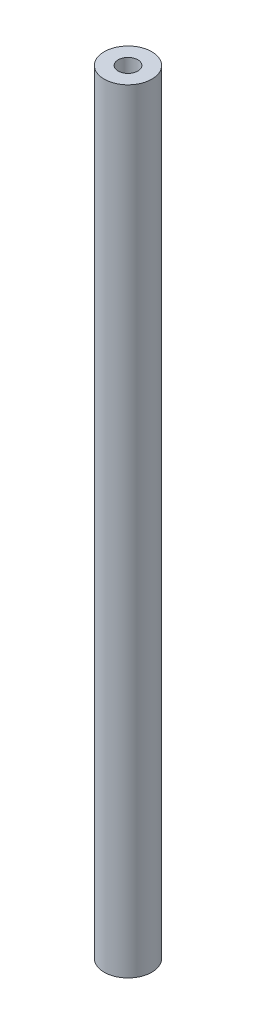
ISO-10303-21;
HEADER;
FILE_DESCRIPTION(('STEP AP214'),'2;1');
FILE_NAME('part.step','',(''),(''),'','','');
FILE_SCHEMA(('AUTOMOTIVE_DESIGN { 1 0 10303 214 1 1 1 1 }'));
ENDSEC;
DATA;
#1=APPLICATION_CONTEXT('core data for automotive mechanical design processes');
#2=APPLICATION_PROTOCOL_DEFINITION('international standard','automotive_design',2000,#1);
#3=PRODUCT_CONTEXT('',#1,'mechanical');
#4=PRODUCT('Part','Part','',(#3));
#5=PRODUCT_RELATED_PRODUCT_CATEGORY('part','',(#4));
#6=PRODUCT_DEFINITION_FORMATION('','',#4);
#7=PRODUCT_DEFINITION_CONTEXT('part definition',#1,'design');
#8=PRODUCT_DEFINITION('design','',#6,#7);
#9=PRODUCT_DEFINITION_SHAPE('','',#8);
#10=(LENGTH_UNIT() NAMED_UNIT(*) SI_UNIT(.MILLI.,.METRE.));
#11=(NAMED_UNIT(*) PLANE_ANGLE_UNIT() SI_UNIT($,.RADIAN.));
#12=(NAMED_UNIT(*) SI_UNIT($,.STERADIAN.) SOLID_ANGLE_UNIT());
#13=UNCERTAINTY_MEASURE_WITH_UNIT(LENGTH_MEASURE(1.E-05),#10,'distance_accuracy_value','');
#14=(GEOMETRIC_REPRESENTATION_CONTEXT(3) GLOBAL_UNCERTAINTY_ASSIGNED_CONTEXT((#13)) GLOBAL_UNIT_ASSIGNED_CONTEXT((#10,
#11,#12)) REPRESENTATION_CONTEXT('',''));
#15=CARTESIAN_POINT('',(0.,0.,0.));
#16=DIRECTION('',(0.,0.,1.));
#17=DIRECTION('',(1.,0.,0.));
#18=AXIS2_PLACEMENT_3D('',#15,#16,#17);
#19=CARTESIAN_POINT('',(0.,119.899999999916,0.));
#20=DIRECTION('',(0.,1.,0.));
#21=DIRECTION('',(0.,0.,1.));
#22=AXIS2_PLACEMENT_3D('',#19,#20,#21);
#23=CONICAL_SURFACE('',#22,1.64999999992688,1.02974425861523);
#24=CARTESIAN_POINT('',(0.,118.908579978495,0.));
#25=VERTEX_POINT('',#24);
#26=VERTEX_LOOP('',#25);
#27=FACE_BOUND('',#26,.T.);
#28=CARTESIAN_POINT('',(0.,119.9,0.));
#29=DIRECTION('',(0.,1.,0.));
#30=DIRECTION('',(0.,0.,1.));
#31=AXIS2_PLACEMENT_3D('',#28,#29,#30);
#32=CIRCLE('',#31,1.64999999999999);
#33=CARTESIAN_POINT('',(0.,119.9,1.64999999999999));
#34=VERTEX_POINT('',#33);
#35=EDGE_CURVE('E37',#34,#34,#32,.T.);
#36=ORIENTED_EDGE('',*,*,#35,.T.);
#37=EDGE_LOOP('',(#36));
#38=FACE_BOUND('',#37,.T.);
#39=ADVANCED_FACE('F17',(#27,#38),#23,.F.);
#40=CARTESIAN_POINT('',(0.,10.1000000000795,0.));
#41=DIRECTION('',(0.,-1.,0.));
#42=DIRECTION('',(0.,0.,-1.));
#43=AXIS2_PLACEMENT_3D('',#40,#41,#42);
#44=CONICAL_SURFACE('',#43,1.64999999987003,1.02974425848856);
#45=CARTESIAN_POINT('',(0.,11.0914200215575,8.5265128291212E-11));
#46=VERTEX_POINT('',#45);
#47=VERTEX_LOOP('',#46);
#48=FACE_BOUND('',#47,.T.);
#49=CARTESIAN_POINT('',(0.,10.1,0.));
#50=DIRECTION('',(0.,-1.,0.));
#51=DIRECTION('',(0.,0.,-1.));
#52=AXIS2_PLACEMENT_3D('',#49,#50,#51);
#53=CIRCLE('',#52,1.65);
#54=CARTESIAN_POINT('',(0.,10.1,-1.65));
#55=VERTEX_POINT('',#54);
#56=EDGE_CURVE('E39',#55,#55,#53,.T.);
#57=ORIENTED_EDGE('',*,*,#56,.T.);
#58=EDGE_LOOP('',(#57));
#59=FACE_BOUND('',#58,.T.);
#60=ADVANCED_FACE('F34',(#48,#59),#44,.F.);
#61=CARTESIAN_POINT('',(0.,130.,0.));
#62=DIRECTION('',(0.,1.,0.));
#63=DIRECTION('',(0.,0.,1.));
#64=AXIS2_PLACEMENT_3D('',#61,#62,#63);
#65=CYLINDRICAL_SURFACE('',#64,1.64999999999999);
#66=CARTESIAN_POINT('',(0.,130.,0.));
#67=DIRECTION('',(0.,1.,0.));
#68=DIRECTION('',(0.,0.,1.));
#69=AXIS2_PLACEMENT_3D('',#66,#67,#68);
#70=CIRCLE('',#69,1.64999999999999);
#71=CARTESIAN_POINT('',(0.,130.,1.64999999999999));
#72=VERTEX_POINT('',#71);
#73=EDGE_CURVE('E20',#72,#72,#70,.F.);
#74=ORIENTED_EDGE('',*,*,#73,.F.);
#75=EDGE_LOOP('',(#74));
#76=FACE_BOUND('',#75,.T.);
#77=ORIENTED_EDGE('',*,*,#35,.F.);
#78=EDGE_LOOP('',(#77));
#79=FACE_BOUND('',#78,.T.);
#80=ADVANCED_FACE('F54',(#76,#79),#65,.F.);
#81=CARTESIAN_POINT('',(0.,0.,0.));
#82=DIRECTION('',(0.,-1.,0.));
#83=DIRECTION('',(0.,0.,-1.));
#84=AXIS2_PLACEMENT_3D('',#81,#82,#83);
#85=CYLINDRICAL_SURFACE('',#84,1.65);
#86=ORIENTED_EDGE('',*,*,#56,.F.);
#87=EDGE_LOOP('',(#86));
#88=FACE_BOUND('',#87,.T.);
#89=CARTESIAN_POINT('',(0.,0.,0.));
#90=DIRECTION('',(0.,-1.,0.));
#91=DIRECTION('',(0.,0.,-1.));
#92=AXIS2_PLACEMENT_3D('',#89,#90,#91);
#93=CIRCLE('',#92,1.65);
#94=CARTESIAN_POINT('',(0.,0.,-1.65));
#95=VERTEX_POINT('',#94);
#96=EDGE_CURVE('E45',#95,#95,#93,.T.);
#97=ORIENTED_EDGE('',*,*,#96,.T.);
#98=EDGE_LOOP('',(#97));
#99=FACE_BOUND('',#98,.T.);
#100=ADVANCED_FACE('F56',(#88,#99),#85,.F.);
#101=CARTESIAN_POINT('',(0.,130.,0.));
#102=DIRECTION('',(0.,1.,0.));
#103=DIRECTION('',(0.,0.,1.));
#104=AXIS2_PLACEMENT_3D('',#101,#102,#103);
#105=PLANE('',#104);
#106=CARTESIAN_POINT('',(0.,130.,0.));
#107=DIRECTION('',(0.,-1.,0.));
#108=DIRECTION('',(0.,0.,-1.));
#109=AXIS2_PLACEMENT_3D('',#106,#107,#108);
#110=CIRCLE('',#109,4.);
#111=CARTESIAN_POINT('',(0.,130.,-4.));
#112=VERTEX_POINT('',#111);
#113=EDGE_CURVE('E26',#112,#112,#110,.T.);
#114=ORIENTED_EDGE('',*,*,#113,.F.);
#115=EDGE_LOOP('',(#114));
#116=FACE_BOUND('',#115,.T.);
#117=ORIENTED_EDGE('',*,*,#73,.T.);
#118=EDGE_LOOP('',(#117));
#119=FACE_BOUND('',#118,.T.);
#120=ADVANCED_FACE('F52',(#116,#119),#105,.T.);
#121=CARTESIAN_POINT('',(0.,0.,0.));
#122=DIRECTION('',(0.,1.,0.));
#123=DIRECTION('',(0.,0.,1.));
#124=AXIS2_PLACEMENT_3D('',#121,#122,#123);
#125=PLANE('',#124);
#126=CARTESIAN_POINT('',(0.,0.,0.));
#127=DIRECTION('',(0.,-1.,0.));
#128=DIRECTION('',(0.,0.,-1.));
#129=AXIS2_PLACEMENT_3D('',#126,#127,#128);
#130=CIRCLE('',#129,4.);
#131=CARTESIAN_POINT('',(0.,0.,-4.));
#132=VERTEX_POINT('',#131);
#133=EDGE_CURVE('E11',#132,#132,#130,.F.);
#134=ORIENTED_EDGE('',*,*,#133,.F.);
#135=EDGE_LOOP('',(#134));
#136=FACE_BOUND('',#135,.T.);
#137=ORIENTED_EDGE('',*,*,#96,.F.);
#138=EDGE_LOOP('',(#137));
#139=FACE_BOUND('',#138,.T.);
#140=ADVANCED_FACE('F67',(#136,#139),#125,.F.);
#141=CARTESIAN_POINT('',(0.,130.,0.));
#142=DIRECTION('',(0.,-1.,0.));
#143=DIRECTION('',(0.,0.,-1.));
#144=AXIS2_PLACEMENT_3D('',#141,#142,#143);
#145=CYLINDRICAL_SURFACE('',#144,4.);
#146=ORIENTED_EDGE('',*,*,#133,.T.);
#147=EDGE_LOOP('',(#146));
#148=FACE_BOUND('',#147,.T.);
#149=ORIENTED_EDGE('',*,*,#113,.T.);
#150=EDGE_LOOP('',(#149));
#151=FACE_BOUND('',#150,.T.);
#152=ADVANCED_FACE('F65',(#148,#151),#145,.T.);
#153=CLOSED_SHELL('',(#39,#60,#80,#100,#120,#140,#152));
#154=MANIFOLD_SOLID_BREP('B1',#153);
#155=ADVANCED_BREP_SHAPE_REPRESENTATION('',(#18,#154),#14);
#156=SHAPE_DEFINITION_REPRESENTATION(#9,#155);
ENDSEC;
END-ISO-10303-21;
